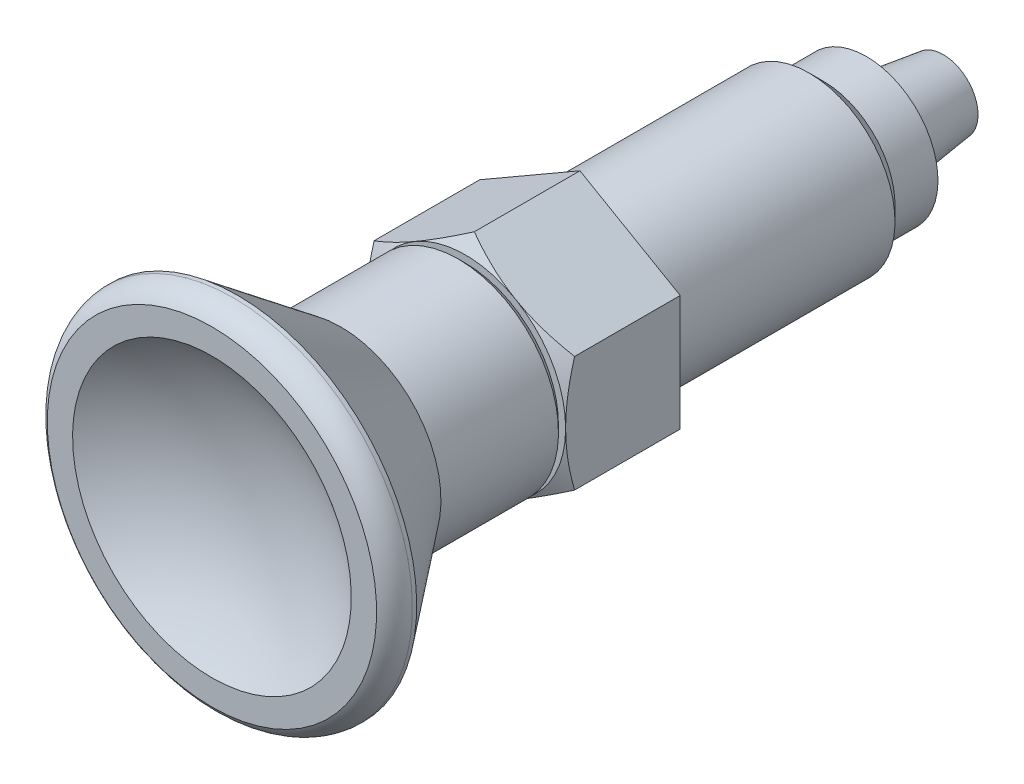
ISO-10303-21;
HEADER;
FILE_DESCRIPTION(('STEP AP214'),'2;1');
FILE_NAME('part.step','',(''),(''),'','','');
FILE_SCHEMA(('AUTOMOTIVE_DESIGN { 1 0 10303 214 1 1 1 1 }'));
ENDSEC;
DATA;
#1=APPLICATION_CONTEXT('core data for automotive mechanical design processes');
#2=APPLICATION_PROTOCOL_DEFINITION('international standard','automotive_design',2000,#1);
#3=PRODUCT_CONTEXT('',#1,'mechanical');
#4=PRODUCT('Part','Part','',(#3));
#5=PRODUCT_RELATED_PRODUCT_CATEGORY('part','',(#4));
#6=PRODUCT_DEFINITION_FORMATION('','',#4);
#7=PRODUCT_DEFINITION_CONTEXT('part definition',#1,'design');
#8=PRODUCT_DEFINITION('design','',#6,#7);
#9=PRODUCT_DEFINITION_SHAPE('','',#8);
#10=(LENGTH_UNIT() NAMED_UNIT(*) SI_UNIT(.MILLI.,.METRE.));
#11=(NAMED_UNIT(*) PLANE_ANGLE_UNIT() SI_UNIT($,.RADIAN.));
#12=(NAMED_UNIT(*) SI_UNIT($,.STERADIAN.) SOLID_ANGLE_UNIT());
#13=UNCERTAINTY_MEASURE_WITH_UNIT(LENGTH_MEASURE(1.E-05),#10,'distance_accuracy_value','');
#14=(GEOMETRIC_REPRESENTATION_CONTEXT(3) GLOBAL_UNCERTAINTY_ASSIGNED_CONTEXT((#13)) GLOBAL_UNIT_ASSIGNED_CONTEXT((#10,
#11,#12)) REPRESENTATION_CONTEXT('',''));
#15=CARTESIAN_POINT('',(0.,0.,0.));
#16=DIRECTION('',(0.,0.,1.));
#17=DIRECTION('',(1.,0.,0.));
#18=AXIS2_PLACEMENT_3D('',#15,#16,#17);
#19=CARTESIAN_POINT('',(0.,0.,-20.));
#20=DIRECTION('',(0.,0.,1.));
#21=DIRECTION('',(0.,1.,0.));
#22=AXIS2_PLACEMENT_3D('',#19,#20,#21);
#23=CYLINDRICAL_SURFACE('',#22,6.);
#24=CARTESIAN_POINT('',(0.,0.,0.));
#25=DIRECTION('',(0.,0.,1.));
#26=DIRECTION('',(0.,1.,0.));
#27=AXIS2_PLACEMENT_3D('',#24,#25,#26);
#28=CIRCLE('',#27,6.);
#29=CARTESIAN_POINT('',(0.,6.,0.));
#30=VERTEX_POINT('',#29);
#31=EDGE_CURVE('E359',#30,#30,#28,.T.);
#32=ORIENTED_EDGE('',*,*,#31,.F.);
#33=EDGE_LOOP('',(#32));
#34=FACE_BOUND('',#33,.T.);
#35=CARTESIAN_POINT('',(0.,0.,-16.));
#36=DIRECTION('',(0.,0.,1.));
#37=DIRECTION('',(0.,1.,0.));
#38=AXIS2_PLACEMENT_3D('',#35,#36,#37);
#39=CIRCLE('',#38,6.);
#40=CARTESIAN_POINT('',(0.,6.,-16.));
#41=VERTEX_POINT('',#40);
#42=EDGE_CURVE('E362',#41,#41,#39,.T.);
#43=ORIENTED_EDGE('',*,*,#42,.T.);
#44=EDGE_LOOP('',(#43));
#45=FACE_BOUND('',#44,.T.);
#46=ADVANCED_FACE('F14',(#34,#45),#23,.T.);
#47=CARTESIAN_POINT('',(-6.,0.,0.));
#48=DIRECTION('',(0.,0.,-1.));
#49=DIRECTION('',(0.,-1.,0.));
#50=AXIS2_PLACEMENT_3D('',#47,#48,#49);
#51=PLANE('',#50);
#52=ORIENTED_EDGE('',*,*,#31,.T.);
#53=EDGE_LOOP('',(#52));
#54=FACE_BOUND('',#53,.T.);
#55=DIRECTION('',(0.,1.,0.));
#56=VECTOR('',#55,1.);
#57=CARTESIAN_POINT('',(7.,-4.04145188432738,0.));
#58=LINE('',#57,#56);
#59=CARTESIAN_POINT('',(7.,-4.04145188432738,0.));
#60=VERTEX_POINT('',#59);
#61=CARTESIAN_POINT('',(7.,4.04145188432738,0.));
#62=VERTEX_POINT('',#61);
#63=EDGE_CURVE('E425',#60,#62,#58,.T.);
#64=ORIENTED_EDGE('',*,*,#63,.F.);
#65=DIRECTION('',(0.866025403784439,0.5,0.));
#66=VECTOR('',#65,1.);
#67=CARTESIAN_POINT('',(0.,-8.08290376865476,0.));
#68=LINE('',#67,#66);
#69=CARTESIAN_POINT('',(0.,-8.08290376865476,0.));
#70=VERTEX_POINT('',#69);
#71=EDGE_CURVE('E430',#70,#60,#68,.T.);
#72=ORIENTED_EDGE('',*,*,#71,.F.);
#73=DIRECTION('',(0.866025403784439,-0.5,0.));
#74=VECTOR('',#73,1.);
#75=CARTESIAN_POINT('',(-7.,-4.04145188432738,0.));
#76=LINE('',#75,#74);
#77=CARTESIAN_POINT('',(-7.,-4.04145188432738,0.));
#78=VERTEX_POINT('',#77);
#79=EDGE_CURVE('E376',#78,#70,#76,.T.);
#80=ORIENTED_EDGE('',*,*,#79,.F.);
#81=DIRECTION('',(0.,-1.,0.));
#82=VECTOR('',#81,1.);
#83=CARTESIAN_POINT('',(-7.,4.04145188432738,0.));
#84=LINE('',#83,#82);
#85=CARTESIAN_POINT('',(-7.,4.04145188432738,0.));
#86=VERTEX_POINT('',#85);
#87=EDGE_CURVE('E361',#86,#78,#84,.T.);
#88=ORIENTED_EDGE('',*,*,#87,.F.);
#89=DIRECTION('',(-0.866025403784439,-0.5,0.));
#90=VECTOR('',#89,1.);
#91=CARTESIAN_POINT('',(0.,8.08290376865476,0.));
#92=LINE('',#91,#90);
#93=CARTESIAN_POINT('',(0.,8.08290376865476,0.));
#94=VERTEX_POINT('',#93);
#95=EDGE_CURVE('E80',#94,#86,#92,.T.);
#96=ORIENTED_EDGE('',*,*,#95,.F.);
#97=DIRECTION('',(-0.866025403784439,0.5,0.));
#98=VECTOR('',#97,1.);
#99=CARTESIAN_POINT('',(7.,4.04145188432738,0.));
#100=LINE('',#99,#98);
#101=EDGE_CURVE('E77',#62,#94,#100,.T.);
#102=ORIENTED_EDGE('',*,*,#101,.F.);
#103=EDGE_LOOP('',(#64,#72,#80,#88,#96,#102));
#104=FACE_BOUND('',#103,.T.);
#105=ADVANCED_FACE('F196',(#54,#104),#51,.T.);
#106=CARTESIAN_POINT('',(-7.,4.04145188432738,0.));
#107=DIRECTION('',(-1.,0.,0.));
#108=DIRECTION('',(0.,-1.,0.));
#109=AXIS2_PLACEMENT_3D('',#106,#107,#108);
#110=PLANE('',#109);
#111=CARTESIAN_POINT('',(-7.,0.,8.));
#112=CARTESIAN_POINT('',(-7.,-0.171536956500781,8.00002860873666));
#113=CARTESIAN_POINT('',(-7.,-0.34306564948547,7.99636029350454));
#114=CARTESIAN_POINT('',(-7.,-0.685786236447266,7.98184244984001));
#115=CARTESIAN_POINT('',(-7.,-0.85697819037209,7.97099434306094));
#116=CARTESIAN_POINT('',(-7.,-1.19791953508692,7.94240098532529));
#117=CARTESIAN_POINT('',(-7.,-1.36767186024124,7.92469045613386));
#118=CARTESIAN_POINT('',(-7.,-1.70636775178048,7.88275321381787));
#119=CARTESIAN_POINT('',(-7.,-1.87531129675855,7.8585263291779));
#120=CARTESIAN_POINT('',(-7.,-2.38022847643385,7.77681957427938));
#121=CARTESIAN_POINT('',(-7.,-2.71473530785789,7.71027392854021));
#122=CARTESIAN_POINT('',(-7.,-3.38087235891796,7.55680264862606));
#123=CARTESIAN_POINT('',(-7.,-3.71247934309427,7.46977523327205));
#124=CARTESIAN_POINT('',(-7.,-4.04145179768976,7.37478524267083));
#125=B_SPLINE_CURVE_WITH_KNOTS('',3,(#111,#112,#113,#114,#115,#116,#117,#118,#119,#120,#121,
#122,#123,#124),.UNSPECIFIED.,.F.,.F.,(4,2,2,2,2,2,4),(0.,0.514558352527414,1.02901484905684,
1.5409016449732,2.05280191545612,3.07526077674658,4.10291207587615),.UNSPECIFIED.);
#126=CARTESIAN_POINT('',(-7.,0.,8.));
#127=VERTEX_POINT('',#126);
#128=CARTESIAN_POINT('',(-7.00000001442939,-4.04145187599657,7.3747852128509));
#129=VERTEX_POINT('',#128);
#130=EDGE_CURVE('E200',#127,#129,#125,.T.);
#131=ORIENTED_EDGE('',*,*,#130,.F.);
#132=CARTESIAN_POINT('',(-6.99999996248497,4.0414519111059,7.37478518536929));
#133=CARTESIAN_POINT('',(-6.99999998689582,3.71247945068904,7.46977519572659));
#134=CARTESIAN_POINT('',(-6.99999999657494,3.38087245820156,7.55680262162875));
#135=CARTESIAN_POINT('',(-7.00000000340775,2.71473538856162,7.71027391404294));
#136=CARTESIAN_POINT('',(-7.00000000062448,2.38022854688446,7.77681956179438));
#137=CARTESIAN_POINT('',(-6.99999999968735,1.87531135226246,7.85852632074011));
#138=CARTESIAN_POINT('',(-6.99999999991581,1.70636780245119,7.88275320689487));
#139=CARTESIAN_POINT('',(-7.00000000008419,1.36767190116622,7.92469045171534));
#140=CARTESIAN_POINT('',(-7.00000000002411,1.19791957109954,7.94240098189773));
#141=CARTESIAN_POINT('',(-6.99999999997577,0.85697821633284,7.97099434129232));
#142=CARTESIAN_POINT('',(-6.99999999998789,0.685786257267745,7.98184244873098));
#143=CARTESIAN_POINT('',(-7.00000000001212,0.343065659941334,7.99636029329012));
#144=CARTESIAN_POINT('',(-7.00000000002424,0.171536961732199,8.00002860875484));
#145=CARTESIAN_POINT('',(-7.,0.,8.));
#146=B_SPLINE_CURVE_WITH_KNOTS('',3,(#132,#133,#134,#135,#136,#137,#138,#139,#140,#141,#142,
#143,#144,#145),.UNSPECIFIED.,.F.,.F.,(4,2,2,2,2,2,4),(0.,1.0276513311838,2.05011022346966,
2.56201050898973,3.07389731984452,3.58835383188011,4.1029122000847),.UNSPECIFIED.);
#147=CARTESIAN_POINT('',(-7.,4.04145190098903,7.3747852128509));
#148=VERTEX_POINT('',#147);
#149=EDGE_CURVE('E206',#148,#127,#146,.T.);
#150=ORIENTED_EDGE('',*,*,#149,.F.);
#151=DIRECTION('',(0.,0.,1.));
#152=VECTOR('',#151,1.);
#153=CARTESIAN_POINT('',(-7.,4.04145188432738,0.));
#154=LINE('',#153,#152);
#155=EDGE_CURVE('E264',#86,#148,#154,.T.);
#156=ORIENTED_EDGE('',*,*,#155,.F.);
#157=ORIENTED_EDGE('',*,*,#87,.T.);
#158=DIRECTION('',(0.,0.,1.));
#159=VECTOR('',#158,1.);
#160=CARTESIAN_POINT('',(-7.,-4.04145188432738,0.));
#161=LINE('',#160,#159);
#162=EDGE_CURVE('E366',#129,#78,#161,.F.);
#163=ORIENTED_EDGE('',*,*,#162,.F.);
#164=EDGE_LOOP('',(#131,#150,#156,#157,#163));
#165=FACE_BOUND('',#164,.T.);
#166=ADVANCED_FACE('F190',(#165),#110,.T.);
#167=CARTESIAN_POINT('',(-7.,-4.04145188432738,0.));
#168=DIRECTION('',(-0.5,-0.866025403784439,0.));
#169=DIRECTION('',(0.866025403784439,-0.5,0.));
#170=AXIS2_PLACEMENT_3D('',#167,#168,#169);
#171=PLANE('',#170);
#172=CARTESIAN_POINT('',(-3.5,-6.06217782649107,8.));
#173=CARTESIAN_POINT('',(-3.35144463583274,-6.1479463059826,8.00002860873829));
#174=CARTESIAN_POINT('',(-3.20289642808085,-6.23371065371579,7.99636029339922));
#175=CARTESIAN_POINT('',(-2.90609168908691,-6.4050709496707,7.98184244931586));
#176=CARTESIAN_POINT('',(-2.75783510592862,-6.49066692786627,7.97099434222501));
#177=CARTESIAN_POINT('',(-2.46257123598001,-6.66113760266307,7.94240098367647));
#178=CARTESIAN_POINT('',(-2.31556140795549,-6.74601376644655,7.92469045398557));
#179=CARTESIAN_POINT('',(-2.02224215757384,-6.91536171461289,7.88275321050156));
#180=CARTESIAN_POINT('',(-1.87593275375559,-6.99983348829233,7.85852632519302));
#181=CARTESIAN_POINT('',(-1.43866164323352,-7.2522920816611,7.77681956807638));
#182=CARTESIAN_POINT('',(-1.14897022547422,-7.41954549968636,7.71027392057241));
#183=CARTESIAN_POINT('',(-0.572078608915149,-7.75261402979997,7.55680263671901));
#184=CARTESIAN_POINT('',(-0.284898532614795,-7.91841752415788,7.4697752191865));
#185=CARTESIAN_POINT('',(-2.59197855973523E-08,-8.08290375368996,7.37478522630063));
#186=B_SPLINE_CURVE_WITH_KNOTS('',3,(#172,#173,#174,#175,#176,#177,#178,#179,#180,#181,#182,
#183,#184,#185),.UNSPECIFIED.,.F.,.F.,(4,2,2,2,2,2,4),(0.,0.514558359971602,1.02901486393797,
1.54090166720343,2.05280194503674,3.07526082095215,4.10291213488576),.UNSPECIFIED.);
#187=CARTESIAN_POINT('',(-3.5,-6.06217782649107,8.));
#188=VERTEX_POINT('',#187);
#189=CARTESIAN_POINT('',(1.15429265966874E-08,-8.08290376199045,7.37478522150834));
#190=VERTEX_POINT('',#189);
#191=EDGE_CURVE('E173',#188,#190,#186,.T.);
#192=ORIENTED_EDGE('',*,*,#191,.F.);
#193=CARTESIAN_POINT('',(-7.00000000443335,-4.04145183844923,7.37478518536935));
#194=CARTESIAN_POINT('',(-6.71510150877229,-4.20593808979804,7.46977519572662));
#195=CARTESIAN_POINT('',(-6.42792143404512,-4.37174159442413,7.55680262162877));
#196=CARTESIAN_POINT('',(-5.85102981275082,-4.70481013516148,7.71027391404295));
#197=CARTESIAN_POINT('',(-5.56133838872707,-4.87206355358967,7.77681956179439));
#198=CARTESIAN_POINT('',(-5.12406727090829,-5.12452215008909,7.85852632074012));
#199=CARTESIAN_POINT('',(-4.97775786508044,-5.20899392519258,7.88275320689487));
#200=CARTESIAN_POINT('',(-4.68443861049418,-5.37834187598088,7.92469045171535));
#201=CARTESIAN_POINT('',(-4.5374287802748,-5.46321804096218,7.94240098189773));
#202=CARTESIAN_POINT('',(-4.24216490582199,-5.63368871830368,7.97099434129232));
#203=CARTESIAN_POINT('',(-4.09390832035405,-5.71928469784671,7.98184244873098));
#204=CARTESIAN_POINT('',(-3.79710357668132,-5.8906449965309,7.99636029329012));
#205=CARTESIAN_POINT('',(-3.6485553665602,-5.97640934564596,8.00002860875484));
#206=CARTESIAN_POINT('',(-3.5,-6.06217782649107,8.));
#207=B_SPLINE_CURVE_WITH_KNOTS('',3,(#193,#194,#195,#196,#197,#198,#199,#200,#201,#202,#203,
#204,#205,#206),.UNSPECIFIED.,.F.,.F.,(4,2,2,2,2,2,4),(0.,1.02765133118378,2.05011022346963,
2.56201050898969,3.07389731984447,3.58835383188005,4.10291220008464),.UNSPECIFIED.);
#208=EDGE_CURVE('E180',#129,#188,#207,.T.);
#209=ORIENTED_EDGE('',*,*,#208,.F.);
#210=ORIENTED_EDGE('',*,*,#162,.T.);
#211=ORIENTED_EDGE('',*,*,#79,.T.);
#212=DIRECTION('',(0.,0.,1.));
#213=VECTOR('',#212,1.);
#214=CARTESIAN_POINT('',(0.,-8.08290376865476,0.));
#215=LINE('',#214,#213);
#216=EDGE_CURVE('E441',#190,#70,#215,.F.);
#217=ORIENTED_EDGE('',*,*,#216,.F.);
#218=EDGE_LOOP('',(#192,#209,#210,#211,#217));
#219=FACE_BOUND('',#218,.T.);
#220=ADVANCED_FACE('F186',(#219),#171,.T.);
#221=CARTESIAN_POINT('',(0.,-8.08290376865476,0.));
#222=DIRECTION('',(0.5,-0.866025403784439,0.));
#223=DIRECTION('',(0.866025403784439,0.5,0.));
#224=AXIS2_PLACEMENT_3D('',#221,#222,#223);
#225=PLANE('',#224);
#226=CARTESIAN_POINT('',(3.5,-6.06217782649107,8.));
#227=CARTESIAN_POINT('',(3.64855536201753,-5.97640934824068,8.00002860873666));
#228=CARTESIAN_POINT('',(3.79710356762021,-5.89064500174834,7.99636029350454));
#229=CARTESIAN_POINT('',(4.09390830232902,-5.71928470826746,7.98184244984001));
#230=CARTESIAN_POINT('',(4.2421648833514,-5.63368873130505,7.97099434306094));
#231=CARTESIAN_POINT('',(4.53742874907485,-5.46321805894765,7.9424009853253));
#232=CARTESIAN_POINT('',(4.68443857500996,-5.37834189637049,7.92469045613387));
#233=CARTESIAN_POINT('',(4.97775782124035,-5.20899395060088,7.88275321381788));
#234=CARTESIAN_POINT('',(5.12406722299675,-5.12452217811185,7.85852632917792));
#235=CARTESIAN_POINT('',(5.56133832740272,-4.87206358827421,7.77681957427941));
#236=CARTESIAN_POINT('',(5.85102974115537,-4.7048101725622,7.71027392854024));
#237=CARTESIAN_POINT('',(6.4279213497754,-4.37174164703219,7.55680264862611));
#238=CARTESIAN_POINT('',(6.71510142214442,-4.20593815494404,7.46977523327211));
#239=CARTESIAN_POINT('',(6.99999992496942,-4.04145192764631,7.37478524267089));
#240=B_SPLINE_CURVE_WITH_KNOTS('',3,(#226,#227,#228,#229,#230,#231,#232,#233,#234,#235,#236,
#237,#238,#239),.UNSPECIFIED.,.F.,.F.,(4,2,2,2,2,2,4),(0.,0.514558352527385,1.02901484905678,
1.54090164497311,2.052801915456,3.0752607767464,4.10291207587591),.UNSPECIFIED.);
#241=CARTESIAN_POINT('',(3.5,-6.06217782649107,8.));
#242=VERTEX_POINT('',#241);
#243=CARTESIAN_POINT('',(7.,-4.04145190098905,7.37478521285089));
#244=VERTEX_POINT('',#243);
#245=EDGE_CURVE('E145',#242,#244,#240,.T.);
#246=ORIENTED_EDGE('',*,*,#245,.F.);
#247=CARTESIAN_POINT('',(1.6541162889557E-08,-8.08290373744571,7.37478521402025));
#248=CARTESIAN_POINT('',(0.284898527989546,-7.91841751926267,7.4697752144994));
#249=CARTESIAN_POINT('',(0.57207860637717,-7.75261402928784,7.55680263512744));
#250=CARTESIAN_POINT('',(1.14897022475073,-7.4195455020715,7.71027392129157));
#251=CARTESIAN_POINT('',(1.4386616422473,-7.25229208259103,7.77681956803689));
#252=CARTESIAN_POINT('',(1.87593275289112,-6.99983348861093,7.85852632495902));
#253=CARTESIAN_POINT('',(2.02224215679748,-6.91536171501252,7.88275321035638));
#254=CARTESIAN_POINT('',(2.31556140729,-6.74601376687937,7.92469045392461));
#255=CARTESIAN_POINT('',(2.46257123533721,-6.66113760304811,7.94240098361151));
#256=CARTESIAN_POINT('',(2.75783510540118,-6.4906669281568,7.97099434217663));
#257=CARTESIAN_POINT('',(2.9060916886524,-6.40507094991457,7.9818424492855));
#258=CARTESIAN_POINT('',(3.20289642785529,-6.23371065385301,7.99636029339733));
#259=CARTESIAN_POINT('',(3.35144463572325,-6.14794630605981,8.00002860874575));
#260=CARTESIAN_POINT('',(3.5,-6.06217782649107,8.));
#261=B_SPLINE_CURVE_WITH_KNOTS('',3,(#247,#248,#249,#250,#251,#252,#253,#254,#255,#256,#257,
#258,#259,#260),.UNSPECIFIED.,.F.,.F.,(4,2,2,2,2,2,4),(0.,1.02765131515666,2.05011019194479,
2.56201046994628,3.07389727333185,3.58835377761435,4.10291213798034),.UNSPECIFIED.);
#262=EDGE_CURVE('E167',#190,#242,#261,.T.);
#263=ORIENTED_EDGE('',*,*,#262,.F.);
#264=ORIENTED_EDGE('',*,*,#216,.T.);
#265=ORIENTED_EDGE('',*,*,#71,.T.);
#266=DIRECTION('',(0.,0.,1.));
#267=VECTOR('',#266,1.);
#268=CARTESIAN_POINT('',(7.,-4.04145188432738,0.));
#269=LINE('',#268,#267);
#270=EDGE_CURVE('E435',#244,#60,#269,.F.);
#271=ORIENTED_EDGE('',*,*,#270,.F.);
#272=EDGE_LOOP('',(#246,#263,#264,#265,#271));
#273=FACE_BOUND('',#272,.T.);
#274=ADVANCED_FACE('F127',(#273),#225,.T.);
#275=CARTESIAN_POINT('',(7.,-4.04145188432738,0.));
#276=DIRECTION('',(1.,0.,0.));
#277=DIRECTION('',(0.,1.,0.));
#278=AXIS2_PLACEMENT_3D('',#275,#276,#277);
#279=PLANE('',#278);
#280=CARTESIAN_POINT('',(7.,0.,8.));
#281=CARTESIAN_POINT('',(7.,0.171536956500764,8.00002860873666));
#282=CARTESIAN_POINT('',(7.,0.343065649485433,7.99636029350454));
#283=CARTESIAN_POINT('',(7.,0.685786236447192,7.98184244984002));
#284=CARTESIAN_POINT('',(7.,0.856978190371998,7.97099434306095));
#285=CARTESIAN_POINT('',(7.,1.19791953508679,7.9424009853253));
#286=CARTESIAN_POINT('',(7.,1.36767186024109,7.92469045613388));
#287=CARTESIAN_POINT('',(7.,1.7063677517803,7.88275321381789));
#288=CARTESIAN_POINT('',(7.,1.87531129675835,7.85852632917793));
#289=CARTESIAN_POINT('',(7.,2.38022847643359,7.77681957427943));
#290=CARTESIAN_POINT('',(7.,2.7147353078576,7.71027392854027));
#291=CARTESIAN_POINT('',(7.,3.3808723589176,7.55680264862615));
#292=CARTESIAN_POINT('',(7.,3.71247934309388,7.46977523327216));
#293=CARTESIAN_POINT('',(7.,4.04145179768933,7.37478524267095));
#294=B_SPLINE_CURVE_WITH_KNOTS('',3,(#280,#281,#282,#283,#284,#285,#286,#287,#288,#289,#290,
#291,#292,#293),.UNSPECIFIED.,.F.,.F.,(4,2,2,2,2,2,4),(0.,0.514558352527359,1.02901484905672,
1.54090164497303,2.0528019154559,3.07526077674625,4.10291207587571),.UNSPECIFIED.);
#295=CARTESIAN_POINT('',(7.,0.,8.));
#296=VERTEX_POINT('',#295);
#297=CARTESIAN_POINT('',(7.00000001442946,4.04145187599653,7.37478521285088));
#298=VERTEX_POINT('',#297);
#299=EDGE_CURVE('E95',#296,#298,#294,.T.);
#300=ORIENTED_EDGE('',*,*,#299,.F.);
#301=CARTESIAN_POINT('',(6.99999996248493,-4.04145191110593,7.37478518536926));
#302=CARTESIAN_POINT('',(6.99999998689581,-3.71247945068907,7.46977519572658));
#303=CARTESIAN_POINT('',(6.99999999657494,-3.38087245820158,7.55680262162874));
#304=CARTESIAN_POINT('',(7.00000000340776,-2.71473538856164,7.71027391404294));
#305=CARTESIAN_POINT('',(7.00000000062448,-2.38022854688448,7.77681956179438));
#306=CARTESIAN_POINT('',(6.99999999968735,-1.87531135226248,7.85852632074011));
#307=CARTESIAN_POINT('',(6.99999999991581,-1.7063678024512,7.88275320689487));
#308=CARTESIAN_POINT('',(7.00000000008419,-1.36767190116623,7.92469045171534));
#309=CARTESIAN_POINT('',(7.00000000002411,-1.19791957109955,7.94240098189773));
#310=CARTESIAN_POINT('',(6.99999999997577,-0.856978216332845,7.97099434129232));
#311=CARTESIAN_POINT('',(6.99999999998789,-0.685786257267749,7.98184244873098));
#312=CARTESIAN_POINT('',(7.00000000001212,-0.343065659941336,7.99636029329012));
#313=CARTESIAN_POINT('',(7.00000000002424,-0.171536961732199,8.00002860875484));
#314=CARTESIAN_POINT('',(7.,0.,8.));
#315=B_SPLINE_CURVE_WITH_KNOTS('',3,(#301,#302,#303,#304,#305,#306,#307,#308,#309,#310,#311,
#312,#313,#314),.UNSPECIFIED.,.F.,.F.,(4,2,2,2,2,2,4),(0.,1.02765133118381,2.05011022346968,
2.56201050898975,3.07389731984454,3.58835383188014,4.10291220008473),.UNSPECIFIED.);
#316=EDGE_CURVE('E137',#244,#296,#315,.T.);
#317=ORIENTED_EDGE('',*,*,#316,.F.);
#318=ORIENTED_EDGE('',*,*,#270,.T.);
#319=ORIENTED_EDGE('',*,*,#63,.T.);
#320=DIRECTION('',(0.,0.,1.));
#321=VECTOR('',#320,1.);
#322=CARTESIAN_POINT('',(7.,4.04145188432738,0.));
#323=LINE('',#322,#321);
#324=EDGE_CURVE('E434',#298,#62,#323,.F.);
#325=ORIENTED_EDGE('',*,*,#324,.F.);
#326=EDGE_LOOP('',(#300,#317,#318,#319,#325));
#327=FACE_BOUND('',#326,.T.);
#328=ADVANCED_FACE('F120',(#327),#279,.T.);
#329=CARTESIAN_POINT('',(7.,4.04145188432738,0.));
#330=DIRECTION('',(0.5,0.866025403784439,0.));
#331=DIRECTION('',(-0.866025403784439,0.5,0.));
#332=AXIS2_PLACEMENT_3D('',#329,#330,#331);
#333=PLANE('',#332);
#334=CARTESIAN_POINT('',(3.5,6.06217782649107,8.));
#335=CARTESIAN_POINT('',(3.35144463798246,6.14794630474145,8.00002860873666));
#336=CARTESIAN_POINT('',(3.20289643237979,6.23371065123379,7.99636029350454));
#337=CARTESIAN_POINT('',(2.90609169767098,6.40507094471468,7.98184244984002));
#338=CARTESIAN_POINT('',(2.75783511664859,6.49066692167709,7.97099434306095));
#339=CARTESIAN_POINT('',(2.46257125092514,6.6611375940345,7.9424009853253));
#340=CARTESIAN_POINT('',(2.31556142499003,6.74601375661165,7.92469045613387));
#341=CARTESIAN_POINT('',(2.02224217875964,6.91536170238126,7.88275321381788));
#342=CARTESIAN_POINT('',(1.87593277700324,6.99983347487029,7.85852632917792));
#343=CARTESIAN_POINT('',(1.43866167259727,7.25229206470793,7.77681957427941));
#344=CARTESIAN_POINT('',(1.14897025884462,7.41954548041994,7.71027392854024));
#345=CARTESIAN_POINT('',(0.572078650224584,7.75261400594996,7.55680264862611));
#346=CARTESIAN_POINT('',(0.284898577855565,7.91841749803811,7.4697752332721));
#347=CARTESIAN_POINT('',(7.50305668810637E-08,8.08290372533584,7.37478524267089));
#348=B_SPLINE_CURVE_WITH_KNOTS('',3,(#334,#335,#336,#337,#338,#339,#340,#341,#342,#343,#344,
#345,#346,#347),.UNSPECIFIED.,.F.,.F.,(4,2,2,2,2,2,4),(0.,0.514558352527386,1.02901484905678,
1.54090164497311,2.05280191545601,3.07526077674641,4.10291207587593),.UNSPECIFIED.);
#349=CARTESIAN_POINT('',(3.5,6.06217782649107,8.));
#350=VERTEX_POINT('',#349);
#351=CARTESIAN_POINT('',(1.44294248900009E-08,8.08290377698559,7.37478521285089));
#352=VERTEX_POINT('',#351);
#353=EDGE_CURVE('E34',#350,#352,#348,.T.);
#354=ORIENTED_EDGE('',*,*,#353,.F.);
#355=CARTESIAN_POINT('',(7.00000000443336,4.041451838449,7.37478518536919));
#356=CARTESIAN_POINT('',(6.71510150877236,4.20593808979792,7.46977519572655));
#357=CARTESIAN_POINT('',(6.42792143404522,4.37174159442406,7.55680262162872));
#358=CARTESIAN_POINT('',(5.85102981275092,4.70481013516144,7.71027391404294));
#359=CARTESIAN_POINT('',(5.56133838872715,4.87206355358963,7.77681956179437));
#360=CARTESIAN_POINT('',(5.12406727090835,5.12452215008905,7.85852632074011));
#361=CARTESIAN_POINT('',(4.97775786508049,5.20899392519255,7.88275320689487));
#362=CARTESIAN_POINT('',(4.68443861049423,5.37834187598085,7.92469045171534));
#363=CARTESIAN_POINT('',(4.53742878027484,5.46321804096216,7.94240098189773));
#364=CARTESIAN_POINT('',(4.24216490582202,5.63368871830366,7.97099434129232));
#365=CARTESIAN_POINT('',(4.09390832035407,5.7192846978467,7.98184244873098));
#366=CARTESIAN_POINT('',(3.79710357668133,5.89064499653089,7.99636029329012));
#367=CARTESIAN_POINT('',(3.6485553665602,5.97640934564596,8.00002860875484));
#368=CARTESIAN_POINT('',(3.5,6.06217782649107,8.));
#369=B_SPLINE_CURVE_WITH_KNOTS('',3,(#355,#356,#357,#358,#359,#360,#361,#362,#363,#364,#365,
#366,#367,#368),.UNSPECIFIED.,.F.,.F.,(4,2,2,2,2,2,4),(0.,1.02765133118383,2.05011022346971,
2.56201050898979,3.07389731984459,3.58835383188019,4.10291220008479),.UNSPECIFIED.);
#370=EDGE_CURVE('E93',#298,#350,#369,.T.);
#371=ORIENTED_EDGE('',*,*,#370,.F.);
#372=ORIENTED_EDGE('',*,*,#324,.T.);
#373=ORIENTED_EDGE('',*,*,#101,.T.);
#374=DIRECTION('',(0.,0.,1.));
#375=VECTOR('',#374,1.);
#376=CARTESIAN_POINT('',(0.,8.08290376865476,0.));
#377=LINE('',#376,#375);
#378=EDGE_CURVE('E72',#352,#94,#377,.F.);
#379=ORIENTED_EDGE('',*,*,#378,.F.);
#380=EDGE_LOOP('',(#354,#371,#372,#373,#379));
#381=FACE_BOUND('',#380,.T.);
#382=ADVANCED_FACE('F73',(#381),#333,.T.);
#383=CARTESIAN_POINT('',(0.,8.08290376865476,0.));
#384=DIRECTION('',(-0.5,0.866025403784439,0.));
#385=DIRECTION('',(-0.866025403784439,-0.5,0.));
#386=AXIS2_PLACEMENT_3D('',#383,#384,#385);
#387=PLANE('',#386);
#388=CARTESIAN_POINT('',(-3.5,6.06217782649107,8.));
#389=CARTESIAN_POINT('',(-3.64855536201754,5.97640934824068,8.00002860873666));
#390=CARTESIAN_POINT('',(-3.79710356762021,5.89064500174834,7.99636029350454));
#391=CARTESIAN_POINT('',(-4.09390830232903,5.71928470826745,7.98184244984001));
#392=CARTESIAN_POINT('',(-4.24216488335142,5.63368873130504,7.97099434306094));
#393=CARTESIAN_POINT('',(-4.53742874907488,5.46321805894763,7.94240098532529));
#394=CARTESIAN_POINT('',(-4.68443857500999,5.37834189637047,7.92469045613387));
#395=CARTESIAN_POINT('',(-4.97775782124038,5.20899395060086,7.88275321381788));
#396=CARTESIAN_POINT('',(-5.12406722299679,5.12452217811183,7.85852632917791));
#397=CARTESIAN_POINT('',(-5.56133832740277,4.87206358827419,7.7768195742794));
#398=CARTESIAN_POINT('',(-5.85102974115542,4.70481017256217,7.71027392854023));
#399=CARTESIAN_POINT('',(-6.42792134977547,4.37174164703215,7.55680264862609));
#400=CARTESIAN_POINT('',(-6.7151014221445,4.205938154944,7.46977523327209));
#401=CARTESIAN_POINT('',(-6.9999999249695,4.04145192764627,7.37478524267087));
#402=B_SPLINE_CURVE_WITH_KNOTS('',3,(#388,#389,#390,#391,#392,#393,#394,#395,#396,#397,#398,
#399,#400,#401),.UNSPECIFIED.,.F.,.F.,(4,2,2,2,2,2,4),(0.,0.514558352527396,1.0290148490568,
1.54090164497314,2.05280191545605,3.07526077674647,4.10291207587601),.UNSPECIFIED.);
#403=CARTESIAN_POINT('',(-3.5,6.06217782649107,8.));
#404=VERTEX_POINT('',#403);
#405=EDGE_CURVE('E68',#404,#148,#402,.T.);
#406=ORIENTED_EDGE('',*,*,#405,.F.);
#407=CARTESIAN_POINT('',(4.19484287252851E-08,8.08290374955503,7.37478518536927));
#408=CARTESIAN_POINT('',(-0.284898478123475,7.91841754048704,7.46977519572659));
#409=CARTESIAN_POINT('',(-0.572078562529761,7.75261405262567,7.55680262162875));
#410=CARTESIAN_POINT('',(-1.14897019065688,7.41954552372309,7.71027391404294));
#411=CARTESIAN_POINT('',(-1.43866161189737,7.25229210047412,7.77681956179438));
#412=CARTESIAN_POINT('',(-1.87593272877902,6.99983350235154,7.85852632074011));
#413=CARTESIAN_POINT('',(-2.02224213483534,6.91536172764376,7.88275320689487));
#414=CARTESIAN_POINT('',(-2.31556138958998,6.74601377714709,7.92469045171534));
#415=CARTESIAN_POINT('',(-2.46257121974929,6.66113761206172,7.94240098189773));
#416=CARTESIAN_POINT('',(-2.75783509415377,6.49066693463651,7.97099434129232));
#417=CARTESIAN_POINT('',(-2.90609167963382,6.40507095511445,7.98184244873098));
#418=CARTESIAN_POINT('',(-3.20289642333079,6.23371065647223,7.99636029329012));
#419=CARTESIAN_POINT('',(-3.35144463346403,6.14794630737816,8.00002860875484));
#420=CARTESIAN_POINT('',(-3.5,6.06217782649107,8.));
#421=B_SPLINE_CURVE_WITH_KNOTS('',3,(#407,#408,#409,#410,#411,#412,#413,#414,#415,#416,#417,
#418,#419,#420),.UNSPECIFIED.,.F.,.F.,(4,2,2,2,2,2,4),(0.,1.02765133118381,2.05011022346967,
2.56201050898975,3.07389731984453,3.58835383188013,4.10291220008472),.UNSPECIFIED.);
#422=EDGE_CURVE('E83',#352,#404,#421,.T.);
#423=ORIENTED_EDGE('',*,*,#422,.F.);
#424=ORIENTED_EDGE('',*,*,#378,.T.);
#425=ORIENTED_EDGE('',*,*,#95,.T.);
#426=ORIENTED_EDGE('',*,*,#155,.T.);
#427=EDGE_LOOP('',(#406,#423,#424,#425,#426));
#428=FACE_BOUND('',#427,.T.);
#429=ADVANCED_FACE('F84',(#428),#387,.T.);
#430=CARTESIAN_POINT('',(0.,0.,7.37103392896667));
#431=DIRECTION('',(0.,0.,-1.));
#432=DIRECTION('',(0.,-1.,0.));
#433=AXIS2_PLACEMENT_3D('',#430,#431,#432);
#434=CONICAL_SURFACE('',#433,8.08940119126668,1.0471975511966);
#435=ORIENTED_EDGE('',*,*,#149,.T.);
#436=CARTESIAN_POINT('',(0.,0.,8.));
#437=DIRECTION('',(0.,0.,-1.));
#438=DIRECTION('',(0.,-1.,0.));
#439=AXIS2_PLACEMENT_3D('',#436,#437,#438);
#440=CIRCLE('',#439,7.);
#441=EDGE_CURVE('E88',#404,#127,#440,.F.);
#442=ORIENTED_EDGE('',*,*,#441,.F.);
#443=ORIENTED_EDGE('',*,*,#405,.T.);
#444=EDGE_LOOP('',(#435,#442,#443));
#445=FACE_BOUND('',#444,.T.);
#446=ADVANCED_FACE('F218',(#445),#434,.T.);
#447=CARTESIAN_POINT('',(0.,0.,7.37103392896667));
#448=DIRECTION('',(0.,0.,-1.));
#449=DIRECTION('',(0.,-1.,0.));
#450=AXIS2_PLACEMENT_3D('',#447,#448,#449);
#451=CONICAL_SURFACE('',#450,8.08940119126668,1.0471975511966);
#452=ORIENTED_EDGE('',*,*,#130,.T.);
#453=ORIENTED_EDGE('',*,*,#208,.T.);
#454=CARTESIAN_POINT('',(0.,0.,8.));
#455=DIRECTION('',(0.,0.,-1.));
#456=DIRECTION('',(0.,-1.,0.));
#457=AXIS2_PLACEMENT_3D('',#454,#455,#456);
#458=CIRCLE('',#457,7.);
#459=EDGE_CURVE('E462',#127,#188,#458,.F.);
#460=ORIENTED_EDGE('',*,*,#459,.F.);
#461=EDGE_LOOP('',(#452,#453,#460));
#462=FACE_BOUND('',#461,.T.);
#463=ADVANCED_FACE('F163',(#462),#451,.T.);
#464=CARTESIAN_POINT('',(0.,0.,7.37103392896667));
#465=DIRECTION('',(0.,0.,-1.));
#466=DIRECTION('',(0.,-1.,0.));
#467=AXIS2_PLACEMENT_3D('',#464,#465,#466);
#468=CONICAL_SURFACE('',#467,8.08940119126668,1.0471975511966);
#469=ORIENTED_EDGE('',*,*,#191,.T.);
#470=ORIENTED_EDGE('',*,*,#262,.T.);
#471=CARTESIAN_POINT('',(0.,0.,8.));
#472=DIRECTION('',(0.,0.,-1.));
#473=DIRECTION('',(0.,-1.,0.));
#474=AXIS2_PLACEMENT_3D('',#471,#472,#473);
#475=CIRCLE('',#474,7.);
#476=EDGE_CURVE('E460',#188,#242,#475,.F.);
#477=ORIENTED_EDGE('',*,*,#476,.F.);
#478=EDGE_LOOP('',(#469,#470,#477));
#479=FACE_BOUND('',#478,.T.);
#480=ADVANCED_FACE('F156',(#479),#468,.T.);
#481=CARTESIAN_POINT('',(0.,0.,7.37103392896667));
#482=DIRECTION('',(0.,0.,-1.));
#483=DIRECTION('',(0.,-1.,0.));
#484=AXIS2_PLACEMENT_3D('',#481,#482,#483);
#485=CONICAL_SURFACE('',#484,8.08940119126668,1.0471975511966);
#486=ORIENTED_EDGE('',*,*,#245,.T.);
#487=ORIENTED_EDGE('',*,*,#316,.T.);
#488=CARTESIAN_POINT('',(0.,0.,8.));
#489=DIRECTION('',(0.,0.,-1.));
#490=DIRECTION('',(0.,-1.,0.));
#491=AXIS2_PLACEMENT_3D('',#488,#489,#490);
#492=CIRCLE('',#491,7.);
#493=EDGE_CURVE('E454',#242,#296,#492,.F.);
#494=ORIENTED_EDGE('',*,*,#493,.F.);
#495=EDGE_LOOP('',(#486,#487,#494));
#496=FACE_BOUND('',#495,.T.);
#497=ADVANCED_FACE('F151',(#496),#485,.T.);
#498=CARTESIAN_POINT('',(0.,0.,7.37103392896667));
#499=DIRECTION('',(0.,0.,-1.));
#500=DIRECTION('',(0.,-1.,0.));
#501=AXIS2_PLACEMENT_3D('',#498,#499,#500);
#502=CONICAL_SURFACE('',#501,8.08940119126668,1.0471975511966);
#503=ORIENTED_EDGE('',*,*,#370,.T.);
#504=CARTESIAN_POINT('',(0.,0.,8.));
#505=DIRECTION('',(0.,0.,-1.));
#506=DIRECTION('',(0.,-1.,0.));
#507=AXIS2_PLACEMENT_3D('',#504,#505,#506);
#508=CIRCLE('',#507,7.);
#509=EDGE_CURVE('E456',#296,#350,#508,.F.);
#510=ORIENTED_EDGE('',*,*,#509,.F.);
#511=ORIENTED_EDGE('',*,*,#299,.T.);
#512=EDGE_LOOP('',(#503,#510,#511));
#513=FACE_BOUND('',#512,.T.);
#514=ADVANCED_FACE('F155',(#513),#502,.T.);
#515=CARTESIAN_POINT('',(0.,0.,7.37103392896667));
#516=DIRECTION('',(0.,0.,-1.));
#517=DIRECTION('',(0.,-1.,0.));
#518=AXIS2_PLACEMENT_3D('',#515,#516,#517);
#519=CONICAL_SURFACE('',#518,8.08940119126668,1.0471975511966);
#520=ORIENTED_EDGE('',*,*,#422,.T.);
#521=CARTESIAN_POINT('',(0.,0.,8.));
#522=DIRECTION('',(0.,0.,-1.));
#523=DIRECTION('',(0.,-1.,0.));
#524=AXIS2_PLACEMENT_3D('',#521,#522,#523);
#525=CIRCLE('',#524,7.);
#526=EDGE_CURVE('E91',#350,#404,#525,.F.);
#527=ORIENTED_EDGE('',*,*,#526,.F.);
#528=ORIENTED_EDGE('',*,*,#353,.T.);
#529=EDGE_LOOP('',(#520,#527,#528));
#530=FACE_BOUND('',#529,.T.);
#531=ADVANCED_FACE('F90',(#530),#519,.T.);
#532=CARTESIAN_POINT('',(0.,0.,38.4));
#533=DIRECTION('',(1.,0.,0.));
#534=DIRECTION('',(0.,-1.,0.));
#535=AXIS2_PLACEMENT_3D('',#532,#533,#534);
#536=SPHERICAL_SURFACE('',#535,16.);
#537=CARTESIAN_POINT('',(0.,-9.73190628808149,25.7));
#538=CARTESIAN_POINT('',(0.273421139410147,-9.73190824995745,25.7));
#539=CARTESIAN_POINT('',(0.546810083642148,-9.72037876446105,25.7));
#540=CARTESIAN_POINT('',(1.091736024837,-9.67434130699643,25.7));
#541=CARTESIAN_POINT('',(1.36327251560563,-9.63982728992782,25.7));
#542=CARTESIAN_POINT('',(1.90275798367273,-9.54800856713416,25.7));
#543=CARTESIAN_POINT('',(2.17070282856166,-9.49067960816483,25.7));
#544=CARTESIAN_POINT('',(2.70081243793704,-9.35363887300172,25.7));
#545=CARTESIAN_POINT('',(2.96297710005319,-9.27392670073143,25.7));
#546=CARTESIAN_POINT('',(3.4795258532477,-9.09273210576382,25.7));
#547=CARTESIAN_POINT('',(3.7339137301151,-8.99126047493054,25.7));
#548=CARTESIAN_POINT('',(4.23323988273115,-8.76724349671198,25.7));
#549=CARTESIAN_POINT('',(4.47817800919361,-8.64469781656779,25.7));
#550=CARTESIAN_POINT('',(4.95679945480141,-8.37943799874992,25.7));
#551=CARTESIAN_POINT('',(5.19048552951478,-8.23672883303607,25.7));
#552=CARTESIAN_POINT('',(5.64500156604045,-7.93213690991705,25.7));
#553=CARTESIAN_POINT('',(5.86583180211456,-7.77025456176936,25.7));
#554=CARTESIAN_POINT('',(6.29309658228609,-7.42844474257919,25.7));
#555=CARTESIAN_POINT('',(6.49952946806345,-7.24851519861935,25.7));
#556=CARTESIAN_POINT('',(6.89650428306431,-6.87190546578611,25.7));
#557=CARTESIAN_POINT('',(7.0870461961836,-6.67522525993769,25.7));
#558=CARTESIAN_POINT('',(7.45089134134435,-6.2665046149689,25.7));
#559=CARTESIAN_POINT('',(7.62419390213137,-6.05446357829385,25.7));
#560=CARTESIAN_POINT('',(7.95231974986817,-5.61653562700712,25.7));
#561=CARTESIAN_POINT('',(8.10714304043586,-5.39064871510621,25.7));
#562=CARTESIAN_POINT('',(8.39720695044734,-4.92663927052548,25.7));
#563=CARTESIAN_POINT('',(8.53244793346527,-4.68851696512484,25.7));
#564=CARTESIAN_POINT('',(8.78238916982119,-4.20172578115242,25.7));
#565=CARTESIAN_POINT('',(8.89708942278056,-3.95305690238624,25.7));
#566=CARTESIAN_POINT('',(9.10513353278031,-3.4469409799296,25.7));
#567=CARTESIAN_POINT('',(9.19847743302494,-3.1894939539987,25.7));
#568=CARTESIAN_POINT('',(9.3631455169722,-2.66765155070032,25.7));
#569=CARTESIAN_POINT('',(9.4344697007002,-2.40325617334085,25.7));
#570=CARTESIAN_POINT('',(9.55459139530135,-1.86939624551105,25.7));
#571=CARTESIAN_POINT('',(9.60338886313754,-1.59993168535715,25.7));
#572=CARTESIAN_POINT('',(9.67811000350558,-1.05784961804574,25.7));
#573=CARTESIAN_POINT('',(9.70403367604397,-0.78523211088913,25.7));
#574=CARTESIAN_POINT('',(9.7328228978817,-0.238782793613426,25.7));
#575=CARTESIAN_POINT('',(9.7356884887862,0.03504901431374,25.7));
#576=CARTESIAN_POINT('',(9.71834128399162,0.581980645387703,25.7));
#577=CARTESIAN_POINT('',(9.69812848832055,0.855080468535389,25.7));
#578=CARTESIAN_POINT('',(9.63476819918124,1.39860665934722,25.7));
#579=CARTESIAN_POINT('',(9.59162069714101,1.66903302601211,25.7));
#580=CARTESIAN_POINT('',(9.4826977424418,2.20528963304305,25.7));
#581=CARTESIAN_POINT('',(9.41692228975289,2.47111987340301,25.7));
#582=CARTESIAN_POINT('',(9.263210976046,2.9962946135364,25.7));
#583=CARTESIAN_POINT('',(9.17527509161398,3.25563910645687,25.7));
#584=CARTESIAN_POINT('',(8.97786812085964,3.7659982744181,25.7));
#585=CARTESIAN_POINT('',(8.86839703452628,4.01701294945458,25.7));
#586=CARTESIAN_POINT('',(8.62869797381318,4.50892783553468,25.7));
#587=CARTESIAN_POINT('',(8.49847000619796,4.7498280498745,25.7));
#588=CARTESIAN_POINT('',(8.2181830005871,5.21980144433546,25.7));
#589=CARTESIAN_POINT('',(8.06812396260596,5.44887462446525,25.7));
#590=CARTESIAN_POINT('',(7.74924171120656,5.89356528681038,25.7));
#591=CARTESIAN_POINT('',(7.58041850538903,6.10918277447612,25.7));
#592=CARTESIAN_POINT('',(7.22520810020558,6.52542924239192,25.7));
#593=CARTESIAN_POINT('',(7.0388209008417,6.72605822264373,25.7));
#594=CARTESIAN_POINT('',(6.64980758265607,7.11090135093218,25.7));
#595=CARTESIAN_POINT('',(6.44718146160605,7.2951154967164,25.7));
#596=CARTESIAN_POINT('',(6.02713087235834,7.64581927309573,25.7));
#597=CARTESIAN_POINT('',(5.80970640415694,7.8123089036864,25.7));
#598=CARTESIAN_POINT('',(5.36160484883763,8.12638002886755,25.7));
#599=CARTESIAN_POINT('',(5.13092775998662,8.27396152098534,25.7));
#600=CARTESIAN_POINT('',(4.65796096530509,8.54916712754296,25.7));
#601=CARTESIAN_POINT('',(4.41567125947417,8.67679124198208,25.7));
#602=CARTESIAN_POINT('',(3.92120177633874,8.91117475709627,25.7));
#603=CARTESIAN_POINT('',(3.66902199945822,9.01793415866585,25.7));
#604=CARTESIAN_POINT('',(3.15656521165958,9.2098292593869,25.7));
#605=CARTESIAN_POINT('',(2.89628820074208,9.29496495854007,25.7));
#606=CARTESIAN_POINT('',(2.36948737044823,9.44300738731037,25.7));
#607=CARTESIAN_POINT('',(2.10296355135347,9.50591411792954,25.7));
#608=CARTESIAN_POINT('',(1.56556391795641,9.60905138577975,25.7));
#609=CARTESIAN_POINT('',(1.29468810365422,9.64928192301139,25.7));
#610=CARTESIAN_POINT('',(0.750510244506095,9.70678078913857,25.7));
#611=CARTESIAN_POINT('',(0.477208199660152,9.7240491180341,25.7));
#612=CARTESIAN_POINT('',(-0.0698791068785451,9.7355007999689,25.7));
#613=CARTESIAN_POINT('',(-0.343664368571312,9.72968415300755,25.7));
#614=CARTESIAN_POINT('',(-0.88977167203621,9.69500723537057,25.7));
#615=CARTESIAN_POINT('',(-1.16209371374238,9.66614696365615,25.7));
#616=CARTESIAN_POINT('',(-1.70333851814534,9.58558797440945,25.7));
#617=CARTESIAN_POINT('',(-1.97226128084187,9.53388925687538,25.7));
#618=CARTESIAN_POINT('',(-2.5047956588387,9.40802092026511,25.7));
#619=CARTESIAN_POINT('',(-2.76840727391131,9.33385130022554,25.7));
#620=CARTESIAN_POINT('',(-3.28844522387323,9.16356846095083,25.7));
#621=CARTESIAN_POINT('',(-3.54487155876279,9.06745524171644,25.7));
#622=CARTESIAN_POINT('',(-4.04871587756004,8.85396852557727,25.7));
#623=CARTESIAN_POINT('',(-4.29613386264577,8.73659503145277,25.7));
#624=CARTESIAN_POINT('',(-4.78020252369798,8.48142221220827,25.7));
#625=CARTESIAN_POINT('',(-5.01685319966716,8.34362288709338,25.7));
#626=CARTESIAN_POINT('',(-5.47770476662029,8.04857809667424,25.7));
#627=CARTESIAN_POINT('',(-5.70190565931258,7.89133263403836,25.7));
#628=CARTESIAN_POINT('',(-6.13626376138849,7.55851347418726,25.7));
#629=CARTESIAN_POINT('',(-6.34642097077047,7.38293977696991,25.7));
#630=CARTESIAN_POINT('',(-6.75119769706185,7.01471229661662,25.7));
#631=CARTESIAN_POINT('',(-6.94581720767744,6.82205850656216,25.7));
#632=CARTESIAN_POINT('',(-7.31813481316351,6.42104055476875,25.7));
#633=CARTESIAN_POINT('',(-7.49583290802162,6.21267639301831,25.7));
#634=CARTESIAN_POINT('',(-7.83304440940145,5.78171897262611,25.7));
#635=CARTESIAN_POINT('',(-7.9925578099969,5.55912570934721,25.7));
#636=CARTESIAN_POINT('',(-8.29226580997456,5.10129265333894,25.7));
#637=CARTESIAN_POINT('',(-8.43246040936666,4.86605286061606,25.7));
#638=CARTESIAN_POINT('',(-8.69253396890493,4.38459941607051,25.7));
#639=CARTESIAN_POINT('',(-8.81241295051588,4.13838577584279,25.7));
#640=CARTESIAN_POINT('',(-9.03100318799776,3.63673483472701,25.7));
#641=CARTESIAN_POINT('',(-9.1297144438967,3.38129753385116,25.7));
#642=CARTESIAN_POINT('',(-9.3052674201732,2.86301537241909,25.7));
#643=CARTESIAN_POINT('',(-9.38210914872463,2.60017051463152,25.7));
#644=CARTESIAN_POINT('',(-9.51337682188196,2.0689418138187,25.7));
#645=CARTESIAN_POINT('',(-9.56780276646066,1.80055797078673,25.7));
#646=CARTESIAN_POINT('',(-9.65385201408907,1.26015885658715,25.7));
#647=CARTESIAN_POINT('',(-9.68547527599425,0.988143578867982,25.7));
#648=CARTESIAN_POINT('',(-9.72569417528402,0.442415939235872,25.7));
#649=CARTESIAN_POINT('',(-9.73428981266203,0.168703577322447,25.7));
#650=CARTESIAN_POINT('',(-9.72839235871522,-0.378471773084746,25.7));
#651=CARTESIAN_POINT('',(-9.7138993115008,-0.651934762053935,25.7));
#652=CARTESIAN_POINT('',(-9.66192760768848,-1.19666773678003,25.7));
#653=CARTESIAN_POINT('',(-9.62444895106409,-1.4679377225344,25.7));
#654=CARTESIAN_POINT('',(-9.52677237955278,-2.00635667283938,25.7));
#655=CARTESIAN_POINT('',(-9.46657441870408,-2.27350562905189,25.7));
#656=CARTESIAN_POINT('',(-9.32388721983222,-2.80178267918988,25.7));
#657=CARTESIAN_POINT('',(-9.24139798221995,-3.06291077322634,25.7));
#658=CARTESIAN_POINT('',(-9.05471294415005,-3.5772944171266,25.7));
#659=CARTESIAN_POINT('',(-8.95051674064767,-3.83054982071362,25.7));
#660=CARTESIAN_POINT('',(-8.72115947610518,-4.32738249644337,25.7));
#661=CARTESIAN_POINT('',(-8.59599841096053,-4.57095976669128,25.7));
#662=CARTESIAN_POINT('',(-8.32560656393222,-5.04669509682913,25.7));
#663=CARTESIAN_POINT('',(-8.18037656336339,-5.27885360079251,25.7));
#664=CARTESIAN_POINT('',(-7.8708757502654,-5.73011089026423,25.7));
#665=CARTESIAN_POINT('',(-7.70660495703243,-5.94920968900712,25.7));
#666=CARTESIAN_POINT('',(-7.36021019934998,-6.37276584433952,25.7));
#667=CARTESIAN_POINT('',(-7.17808828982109,-6.57722488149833,25.7));
#668=CARTESIAN_POINT('',(-6.79726585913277,-6.97008025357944,25.7));
#669=CARTESIAN_POINT('',(-6.59856498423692,-7.15847624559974,25.7));
#670=CARTESIAN_POINT('',(-6.18594941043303,-7.51790585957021,25.7));
#671=CARTESIAN_POINT('',(-5.97203097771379,-7.68893519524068,25.7));
#672=CARTESIAN_POINT('',(-5.53054854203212,-8.01235979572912,25.7));
#673=CARTESIAN_POINT('',(-5.30298475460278,-8.16475535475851,25.7));
#674=CARTESIAN_POINT('',(-4.8357105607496,-8.44990255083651,25.7));
#675=CARTESIAN_POINT('',(-4.59599419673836,-8.58264442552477,25.7));
#676=CARTESIAN_POINT('',(-4.10623086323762,-8.82744687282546,25.7));
#677=CARTESIAN_POINT('',(-3.85618407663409,-8.93950781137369,25.7));
#678=CARTESIAN_POINT('',(-3.34780095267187,-9.14204631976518,25.7));
#679=CARTESIAN_POINT('',(-3.089473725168,-9.23254674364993,25.7));
#680=CARTESIAN_POINT('',(-2.56620241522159,-9.39145195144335,25.7));
#681=CARTESIAN_POINT('',(-2.30126009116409,-9.45986254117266,25.7));
#682=CARTESIAN_POINT('',(-1.69995282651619,-9.58836325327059,25.7));
#683=CARTESIAN_POINT('',(-1.36222155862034,-9.6421462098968,25.7));
#684=CARTESIAN_POINT('',(-0.682976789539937,-9.71391650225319,25.7));
#685=CARTESIAN_POINT('',(-0.341463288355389,-9.73190383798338,25.7));
#686=CARTESIAN_POINT('',(0.,-9.73190628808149,25.7));
#687=B_SPLINE_CURVE_WITH_KNOTS('',3,(#537,#538,#539,#540,#541,#542,#543,#544,#545,#546,#547,
#548,#549,#550,#551,#552,#553,#554,#555,#556,#557,#558,#559,#560,#561,#562,#563,#564,#565,#566,
#567,#568,#569,#570,#571,#572,#573,#574,#575,#576,#577,#578,#579,#580,#581,#582,#583,#584,#585,
#586,#587,#588,#589,#590,#591,#592,#593,#594,#595,#596,#597,#598,#599,#600,#601,#602,#603,#604,
#605,#606,#607,#608,#609,#610,#611,#612,#613,#614,#615,#616,#617,#618,#619,#620,#621,#622,#623,
#624,#625,#626,#627,#628,#629,#630,#631,#632,#633,#634,#635,#636,#637,#638,#639,#640,#641,#642,
#643,#644,#645,#646,#647,#648,#649,#650,#651,#652,#653,#654,#655,#656,#657,#658,#659,#660,#661,
#662,#663,#664,#665,#666,#667,#668,#669,#670,#671,#672,#673,#674,#675,#676,#677,#678,#679,#680,
#681,#682,#683,#684,#685,#686),.UNSPECIFIED.,.T.,.F.,(4,2,2,2,2,2,2,2,2,2,2,2,2,2,2,2,2,2,2,2,2,
2,2,2,2,2,2,2,2,2,2,2,2,2,2,2,2,2,2,2,2,2,2,2,2,2,2,2,2,2,2,2,2,2,2,2,2,2,2,2,2,2,2,2,2,2,2,2,2,
2,2,2,2,2,4),(0.,0.819965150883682,1.64014604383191,2.46120116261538,3.28227081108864,
4.10293417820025,4.92361050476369,5.74408481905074,6.56454162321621,7.38509277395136,
8.20564475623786,9.02622867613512,9.8468124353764,10.6673809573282,11.4879494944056,
12.3085163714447,13.1290832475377,13.9496516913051,14.7702201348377,15.5907870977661,
16.411354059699,17.2319213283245,18.0524885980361,18.8730567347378,19.6936248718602,
20.5141927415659,21.3347606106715,22.1553281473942,22.9758956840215,23.7964633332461,
24.6170309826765,25.4375987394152,26.2581664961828,27.0787342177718,27.8993019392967,
28.7198696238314,29.5404373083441,30.3610049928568,31.1815726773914,32.0021403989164,
32.8227081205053,33.6432758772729,34.4638436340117,35.284411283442,36.1049789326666,
36.9255464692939,37.7461140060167,38.5666818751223,39.3872497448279,40.2078178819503,
41.028386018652,41.8489532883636,42.6695205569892,43.4900875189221,44.3106544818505,
45.1312229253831,45.9517913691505,46.7723582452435,47.5929251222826,48.41349365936,
49.2340621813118,50.054645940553,50.8752298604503,51.6957818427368,52.516332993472,
53.3367897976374,54.1572641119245,54.9779404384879,55.7986038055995,56.6196734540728,
57.4407285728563,58.2609094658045,59.0808746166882,60.1048919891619,61.1289093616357),.UNSPECIFIED.);
#688=CARTESIAN_POINT('',(0.,-9.73190628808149,25.7));
#689=VERTEX_POINT('',#688);
#690=EDGE_CURVE('E272',#689,#689,#687,.T.);
#691=ORIENTED_EDGE('',*,*,#690,.T.);
#692=EDGE_LOOP('',(#691));
#693=FACE_BOUND('',#692,.T.);
#694=ADVANCED_FACE('F265',(#693),#536,.F.);
#695=CARTESIAN_POINT('',(-7.,0.,8.));
#696=DIRECTION('',(0.,0.,1.));
#697=DIRECTION('',(0.,1.,0.));
#698=AXIS2_PLACEMENT_3D('',#695,#696,#697);
#699=PLANE('',#698);
#700=ORIENTED_EDGE('',*,*,#509,.T.);
#701=ORIENTED_EDGE('',*,*,#526,.T.);
#702=ORIENTED_EDGE('',*,*,#441,.T.);
#703=ORIENTED_EDGE('',*,*,#459,.T.);
#704=ORIENTED_EDGE('',*,*,#476,.T.);
#705=ORIENTED_EDGE('',*,*,#493,.T.);
#706=EDGE_LOOP('',(#700,#701,#702,#703,#704,#705));
#707=FACE_BOUND('',#706,.T.);
#708=CARTESIAN_POINT('',(0.,0.,8.));
#709=DIRECTION('',(0.,0.,1.));
#710=DIRECTION('',(0.,1.,0.));
#711=AXIS2_PLACEMENT_3D('',#708,#709,#710);
#712=CIRCLE('',#711,6.5);
#713=CARTESIAN_POINT('',(0.,6.5,8.));
#714=VERTEX_POINT('',#713);
#715=EDGE_CURVE('E279',#714,#714,#712,.T.);
#716=ORIENTED_EDGE('',*,*,#715,.F.);
#717=EDGE_LOOP('',(#716));
#718=FACE_BOUND('',#717,.T.);
#719=ADVANCED_FACE('F269',(#707,#718),#699,.T.);
#720=CARTESIAN_POINT('',(-9.73190628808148,0.,25.7));
#721=DIRECTION('',(0.,0.,-1.));
#722=DIRECTION('',(0.,-1.,0.));
#723=AXIS2_PLACEMENT_3D('',#720,#721,#722);
#724=PLANE('',#723);
#725=ORIENTED_EDGE('',*,*,#690,.F.);
#726=EDGE_LOOP('',(#725));
#727=FACE_BOUND('',#726,.T.);
#728=CARTESIAN_POINT('',(0.,0.,25.7));
#729=DIRECTION('',(0.,0.,-1.));
#730=DIRECTION('',(0.,-1.,0.));
#731=AXIS2_PLACEMENT_3D('',#728,#729,#730);
#732=CIRCLE('',#731,11.5);
#733=CARTESIAN_POINT('',(0.,-11.5,25.7));
#734=VERTEX_POINT('',#733);
#735=EDGE_CURVE('E297',#734,#734,#732,.T.);
#736=ORIENTED_EDGE('',*,*,#735,.F.);
#737=EDGE_LOOP('',(#736));
#738=FACE_BOUND('',#737,.T.);
#739=ADVANCED_FACE('F282',(#727,#738),#724,.F.);
#740=CARTESIAN_POINT('',(0.,0.,8.5));
#741=DIRECTION('',(0.,0.,1.));
#742=DIRECTION('',(0.,1.,0.));
#743=AXIS2_PLACEMENT_3D('',#740,#741,#742);
#744=CONICAL_SURFACE('',#743,7.,0.785398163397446);
#745=CARTESIAN_POINT('',(0.,0.,8.5));
#746=DIRECTION('',(0.,0.,1.));
#747=DIRECTION('',(0.,1.,0.));
#748=AXIS2_PLACEMENT_3D('',#745,#746,#747);
#749=CIRCLE('',#748,7.);
#750=CARTESIAN_POINT('',(0.,7.,8.5));
#751=VERTEX_POINT('',#750);
#752=EDGE_CURVE('E299',#751,#751,#749,.T.);
#753=ORIENTED_EDGE('',*,*,#752,.F.);
#754=EDGE_LOOP('',(#753));
#755=FACE_BOUND('',#754,.T.);
#756=ORIENTED_EDGE('',*,*,#715,.T.);
#757=EDGE_LOOP('',(#756));
#758=FACE_BOUND('',#757,.T.);
#759=ADVANCED_FACE('F254',(#755,#758),#744,.T.);
#760=CARTESIAN_POINT('',(0.,0.,23.9596620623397));
#761=DIRECTION('',(0.,0.,-1.));
#762=DIRECTION('',(0.,-1.,0.));
#763=AXIS2_PLACEMENT_3D('',#760,#761,#762);
#764=TOROIDAL_SURFACE('',#763,10.5144930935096,2.);
#765=CARTESIAN_POINT('',(0.,0.,24.2));
#766=DIRECTION('',(0.,0.,1.));
#767=DIRECTION('',(0.,1.,0.));
#768=AXIS2_PLACEMENT_3D('',#765,#766,#767);
#769=CIRCLE('',#768,12.5);
#770=CARTESIAN_POINT('',(0.,12.5,24.2));
#771=VERTEX_POINT('',#770);
#772=EDGE_CURVE('E301',#771,#771,#769,.F.);
#773=ORIENTED_EDGE('',*,*,#772,.F.);
#774=EDGE_LOOP('',(#773));
#775=FACE_BOUND('',#774,.T.);
#776=ORIENTED_EDGE('',*,*,#735,.T.);
#777=EDGE_LOOP('',(#776));
#778=FACE_BOUND('',#777,.T.);
#779=ADVANCED_FACE('F249',(#775,#778),#764,.T.);
#780=CARTESIAN_POINT('',(0.,0.,-26.));
#781=DIRECTION('',(0.,0.,1.));
#782=DIRECTION('',(0.,1.,0.));
#783=AXIS2_PLACEMENT_3D('',#780,#781,#782);
#784=CYLINDRICAL_SURFACE('',#783,7.);
#785=CARTESIAN_POINT('',(0.,0.,16.7062986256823));
#786=DIRECTION('',(0.,0.,1.));
#787=DIRECTION('',(0.,1.,0.));
#788=AXIS2_PLACEMENT_3D('',#785,#786,#787);
#789=CIRCLE('',#788,7.);
#790=CARTESIAN_POINT('',(0.,7.,16.7062986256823));
#791=VERTEX_POINT('',#790);
#792=EDGE_CURVE('E25',#791,#791,#789,.T.);
#793=ORIENTED_EDGE('',*,*,#792,.F.);
#794=EDGE_LOOP('',(#793));
#795=FACE_BOUND('',#794,.T.);
#796=ORIENTED_EDGE('',*,*,#752,.T.);
#797=EDGE_LOOP('',(#796));
#798=FACE_BOUND('',#797,.T.);
#799=ADVANCED_FACE('F242',(#795,#798),#784,.T.);
#800=CARTESIAN_POINT('',(0.,0.,-26.));
#801=DIRECTION('',(0.,0.,1.));
#802=DIRECTION('',(0.,1.,0.));
#803=AXIS2_PLACEMENT_3D('',#800,#801,#802);
#804=CYLINDRICAL_SURFACE('',#803,12.5);
#805=ORIENTED_EDGE('',*,*,#772,.T.);
#806=EDGE_LOOP('',(#805));
#807=FACE_BOUND('',#806,.T.);
#808=CARTESIAN_POINT('',(0.,0.,23.9));
#809=DIRECTION('',(0.,0.,1.));
#810=DIRECTION('',(0.,1.,0.));
#811=AXIS2_PLACEMENT_3D('',#808,#809,#810);
#812=CIRCLE('',#811,12.5);
#813=CARTESIAN_POINT('',(0.,12.5,23.9));
#814=VERTEX_POINT('',#813);
#815=EDGE_CURVE('E9',#814,#814,#812,.F.);
#816=ORIENTED_EDGE('',*,*,#815,.F.);
#817=EDGE_LOOP('',(#816));
#818=FACE_BOUND('',#817,.T.);
#819=ADVANCED_FACE('F232',(#807,#818),#804,.T.);
#820=CARTESIAN_POINT('',(0.,0.,23.9));
#821=DIRECTION('',(0.,0.,1.));
#822=DIRECTION('',(0.,1.,0.));
#823=AXIS2_PLACEMENT_3D('',#820,#821,#822);
#824=CONICAL_SURFACE('',#823,12.5,0.65275314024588);
#825=ORIENTED_EDGE('',*,*,#815,.T.);
#826=EDGE_LOOP('',(#825));
#827=FACE_BOUND('',#826,.T.);
#828=ORIENTED_EDGE('',*,*,#792,.T.);
#829=EDGE_LOOP('',(#828));
#830=FACE_BOUND('',#829,.T.);
#831=ADVANCED_FACE('F230',(#827,#830),#824,.T.);
#832=CARTESIAN_POINT('',(0.,0.,-21.));
#833=DIRECTION('',(1.,0.,0.));
#834=DIRECTION('',(0.,-1.,0.));
#835=AXIS2_PLACEMENT_3D('',#832,#833,#834);
#836=SPHERICAL_SURFACE('',#835,5.);
#837=CARTESIAN_POINT('',(0.,0.,-25.3729654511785));
#838=DIRECTION('',(0.,0.,1.));
#839=DIRECTION('',(0.,1.,0.));
#840=AXIS2_PLACEMENT_3D('',#837,#838,#839);
#841=CIRCLE('',#840,2.42428817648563);
#842=CARTESIAN_POINT('',(0.,2.42428817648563,-25.3729654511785));
#843=VERTEX_POINT('',#842);
#844=EDGE_CURVE('E19',#843,#843,#841,.T.);
#845=ORIENTED_EDGE('',*,*,#844,.F.);
#846=EDGE_LOOP('',(#845));
#847=FACE_BOUND('',#846,.T.);
#848=ADVANCED_FACE('F16',(#847),#836,.T.);
#849=CARTESIAN_POINT('',(0.,0.,-21.0000000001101));
#850=DIRECTION('',(0.,0.,1.));
#851=DIRECTION('',(0.,1.,0.));
#852=AXIS2_PLACEMENT_3D('',#849,#850,#851);
#853=CONICAL_SURFACE('',#852,2.99999999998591,0.130899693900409);
#854=CARTESIAN_POINT('',(0.,0.,-21.));
#855=DIRECTION('',(0.,0.,1.));
#856=DIRECTION('',(0.,1.,0.));
#857=AXIS2_PLACEMENT_3D('',#854,#855,#856);
#858=CIRCLE('',#857,3.);
#859=CARTESIAN_POINT('',(0.,3.,-21.));
#860=VERTEX_POINT('',#859);
#861=EDGE_CURVE('E307',#860,#860,#858,.T.);
#862=ORIENTED_EDGE('',*,*,#861,.F.);
#863=EDGE_LOOP('',(#862));
#864=FACE_BOUND('',#863,.T.);
#865=ORIENTED_EDGE('',*,*,#844,.T.);
#866=EDGE_LOOP('',(#865));
#867=FACE_BOUND('',#866,.T.);
#868=ADVANCED_FACE('F240',(#864,#867),#853,.T.);
#869=CARTESIAN_POINT('',(0.,0.,-26.));
#870=DIRECTION('',(0.,0.,1.));
#871=DIRECTION('',(0.,1.,0.));
#872=AXIS2_PLACEMENT_3D('',#869,#870,#871);
#873=CYLINDRICAL_SURFACE('',#872,3.);
#874=CARTESIAN_POINT('',(0.,0.,-20.3732050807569));
#875=DIRECTION('',(0.,0.,-1.));
#876=DIRECTION('',(0.,-1.,0.));
#877=AXIS2_PLACEMENT_3D('',#874,#875,#876);
#878=CIRCLE('',#877,3.);
#879=CARTESIAN_POINT('',(0.,-3.,-20.3732050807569));
#880=VERTEX_POINT('',#879);
#881=EDGE_CURVE('E310',#880,#880,#878,.T.);
#882=ORIENTED_EDGE('',*,*,#881,.T.);
#883=EDGE_LOOP('',(#882));
#884=FACE_BOUND('',#883,.T.);
#885=ORIENTED_EDGE('',*,*,#861,.T.);
#886=EDGE_LOOP('',(#885));
#887=FACE_BOUND('',#886,.T.);
#888=ADVANCED_FACE('F329',(#884,#887),#873,.T.);
#889=CARTESIAN_POINT('',(0.,0.,-20.2));
#890=DIRECTION('',(0.,0.,-1.));
#891=DIRECTION('',(0.,-1.,0.));
#892=AXIS2_PLACEMENT_3D('',#889,#890,#891);
#893=TOROIDAL_SURFACE('',#892,3.1,0.2);
#894=CARTESIAN_POINT('',(0.,0.,-20.));
#895=DIRECTION('',(0.,0.,-1.));
#896=DIRECTION('',(0.,-1.,0.));
#897=AXIS2_PLACEMENT_3D('',#894,#895,#896);
#898=CIRCLE('',#897,3.1);
#899=CARTESIAN_POINT('',(0.,-3.1,-20.));
#900=VERTEX_POINT('',#899);
#901=EDGE_CURVE('E340',#900,#900,#898,.T.);
#902=ORIENTED_EDGE('',*,*,#901,.T.);
#903=EDGE_LOOP('',(#902));
#904=FACE_BOUND('',#903,.T.);
#905=ORIENTED_EDGE('',*,*,#881,.F.);
#906=EDGE_LOOP('',(#905));
#907=FACE_BOUND('',#906,.T.);
#908=ADVANCED_FACE('F317',(#904,#907),#893,.F.);
#909=CARTESIAN_POINT('',(-3.95,0.,-20.));
#910=DIRECTION('',(0.,0.,1.));
#911=DIRECTION('',(0.,1.,0.));
#912=AXIS2_PLACEMENT_3D('',#909,#910,#911);
#913=PLANE('',#912);
#914=CARTESIAN_POINT('',(0.,0.,-19.9999999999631));
#915=DIRECTION('',(0.,0.,1.));
#916=DIRECTION('',(0.,1.,0.));
#917=AXIS2_PLACEMENT_3D('',#914,#915,#916);
#918=CIRCLE('',#917,3.95000000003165);
#919=CARTESIAN_POINT('',(0.,3.95000000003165,-19.9999999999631));
#920=VERTEX_POINT('',#919);
#921=EDGE_CURVE('E344',#920,#920,#918,.T.);
#922=ORIENTED_EDGE('',*,*,#921,.F.);
#923=EDGE_LOOP('',(#922));
#924=FACE_BOUND('',#923,.T.);
#925=ORIENTED_EDGE('',*,*,#901,.F.);
#926=EDGE_LOOP('',(#925));
#927=FACE_BOUND('',#926,.T.);
#928=ADVANCED_FACE('F328',(#924,#927),#913,.F.);
#929=CARTESIAN_POINT('',(0.,0.,-19.7000000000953));
#930=DIRECTION('',(0.,0.,1.));
#931=DIRECTION('',(0.,1.,0.));
#932=AXIS2_PLACEMENT_3D('',#929,#930,#931);
#933=CONICAL_SURFACE('',#932,4.24999999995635,0.785398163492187);
#934=CARTESIAN_POINT('',(0.,0.,-19.7));
#935=DIRECTION('',(0.,0.,1.));
#936=DIRECTION('',(0.,1.,0.));
#937=AXIS2_PLACEMENT_3D('',#934,#935,#936);
#938=CIRCLE('',#937,4.25);
#939=CARTESIAN_POINT('',(0.,4.25,-19.7));
#940=VERTEX_POINT('',#939);
#941=EDGE_CURVE('E347',#940,#940,#938,.F.);
#942=ORIENTED_EDGE('',*,*,#941,.T.);
#943=EDGE_LOOP('',(#942));
#944=FACE_BOUND('',#943,.T.);
#945=ORIENTED_EDGE('',*,*,#921,.T.);
#946=EDGE_LOOP('',(#945));
#947=FACE_BOUND('',#946,.T.);
#948=ADVANCED_FACE('F385',(#944,#947),#933,.T.);
#949=CARTESIAN_POINT('',(0.,0.,-20.));
#950=DIRECTION('',(0.,0.,1.));
#951=DIRECTION('',(0.,1.,0.));
#952=AXIS2_PLACEMENT_3D('',#949,#950,#951);
#953=CYLINDRICAL_SURFACE('',#952,4.25);
#954=ORIENTED_EDGE('',*,*,#941,.F.);
#955=EDGE_LOOP('',(#954));
#956=FACE_BOUND('',#955,.T.);
#957=CARTESIAN_POINT('',(0.,0.,-20.));
#958=DIRECTION('',(0.,0.,1.));
#959=DIRECTION('',(0.,1.,0.));
#960=AXIS2_PLACEMENT_3D('',#957,#958,#959);
#961=CIRCLE('',#960,4.25);
#962=CARTESIAN_POINT('',(0.,4.25,-20.));
#963=VERTEX_POINT('',#962);
#964=EDGE_CURVE('E351',#963,#963,#961,.T.);
#965=ORIENTED_EDGE('',*,*,#964,.F.);
#966=EDGE_LOOP('',(#965));
#967=FACE_BOUND('',#966,.T.);
#968=ADVANCED_FACE('F391',(#956,#967),#953,.F.);
#969=CARTESIAN_POINT('',(-4.25,0.,-20.));
#970=DIRECTION('',(0.,0.,-1.));
#971=DIRECTION('',(0.,-1.,0.));
#972=AXIS2_PLACEMENT_3D('',#969,#970,#971);
#973=PLANE('',#972);
#974=ORIENTED_EDGE('',*,*,#964,.T.);
#975=EDGE_LOOP('',(#974));
#976=FACE_BOUND('',#975,.T.);
#977=CARTESIAN_POINT('',(0.,0.,-20.));
#978=DIRECTION('',(0.,0.,1.));
#979=DIRECTION('',(0.,1.,0.));
#980=AXIS2_PLACEMENT_3D('',#977,#978,#979);
#981=CIRCLE('',#980,5.);
#982=CARTESIAN_POINT('',(0.,5.,-20.));
#983=VERTEX_POINT('',#982);
#984=EDGE_CURVE('E356',#983,#983,#981,.T.);
#985=ORIENTED_EDGE('',*,*,#984,.F.);
#986=EDGE_LOOP('',(#985));
#987=FACE_BOUND('',#986,.T.);
#988=ADVANCED_FACE('F397',(#976,#987),#973,.T.);
#989=CARTESIAN_POINT('',(0.,0.,-20.));
#990=DIRECTION('',(0.,0.,1.));
#991=DIRECTION('',(0.,1.,0.));
#992=AXIS2_PLACEMENT_3D('',#989,#990,#991);
#993=CYLINDRICAL_SURFACE('',#992,5.);
#994=ORIENTED_EDGE('',*,*,#984,.T.);
#995=EDGE_LOOP('',(#994));
#996=FACE_BOUND('',#995,.T.);
#997=CARTESIAN_POINT('',(0.,0.,-16.9999999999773));
#998=DIRECTION('',(0.,0.,1.));
#999=DIRECTION('',(0.,1.,0.));
#1000=AXIS2_PLACEMENT_3D('',#997,#998,#999);
#1001=CIRCLE('',#1000,4.99999999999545);
#1002=CARTESIAN_POINT('',(0.,4.99999999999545,-16.9999999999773));
#1003=VERTEX_POINT('',#1002);
#1004=EDGE_CURVE('E358',#1003,#1003,#1001,.T.);
#1005=ORIENTED_EDGE('',*,*,#1004,.F.);
#1006=EDGE_LOOP('',(#1005));
#1007=FACE_BOUND('',#1006,.T.);
#1008=ADVANCED_FACE('F403',(#996,#1007),#993,.T.);
#1009=CARTESIAN_POINT('',(0.,0.,-16.0000000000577));
#1010=DIRECTION('',(0.,0.,1.));
#1011=DIRECTION('',(0.,1.,0.));
#1012=AXIS2_PLACEMENT_3D('',#1009,#1010,#1011);
#1013=CONICAL_SURFACE('',#1012,5.99999999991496,0.785398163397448);
#1014=ORIENTED_EDGE('',*,*,#1004,.T.);
#1015=EDGE_LOOP('',(#1014));
#1016=FACE_BOUND('',#1015,.T.);
#1017=ORIENTED_EDGE('',*,*,#42,.F.);
#1018=EDGE_LOOP('',(#1017));
#1019=FACE_BOUND('',#1018,.T.);
#1020=ADVANCED_FACE('F407',(#1016,#1019),#1013,.T.);
#1021=CLOSED_SHELL('',(#46,#105,#166,#220,#274,#328,#382,#429,#446,#463,#480,#497,#514,#531,
#694,#719,#739,#759,#779,#799,#819,#831,#848,#868,#888,#908,#928,#948,#968,#988,#1008,#1020));
#1022=MANIFOLD_SOLID_BREP('B1',#1021);
#1023=ADVANCED_BREP_SHAPE_REPRESENTATION('',(#18,#1022),#14);
#1024=SHAPE_DEFINITION_REPRESENTATION(#9,#1023);
ENDSEC;
END-ISO-10303-21;
